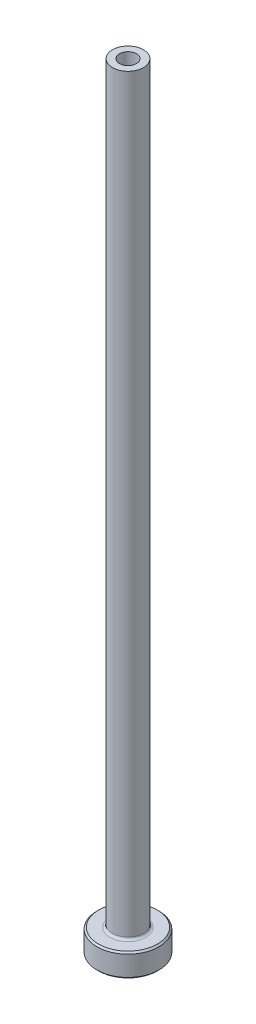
from build123d import *

# Parameters (mm, degrees)
FILLET1_R     = 0.3
CHAMFER1_SIZE = 0.2
CHAMFER3_SIZE = 0.5


with BuildPart() as part:
    # Sketch1 → Revolve1 (revolve)
    with BuildSketch(Plane.XY, mode=Mode.PRIVATE) as revolve1_sk:
        Polygon((-1.1, 100), (-2, 100), (-2, 3), (-4, 3), (-4, 0), (-1.35, 0), (-1.35, 53), (-1.1, 65), align=None)
    revolve(revolve1_sk.sketch.rotate(Axis((0, 92.187680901, 0), (0, -1, 0)), 270), axis=Axis((0, 92.187680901, 0), (0, -1, 0)))

    # Fillet1
    fillet1_edges = [part.edges().sort_by_distance(p)[0] for p in [
        (0, 3, -2),
    ]]
    fillet(fillet1_edges, radius=FILLET1_R)

    # Chamfer1
    chamfer1_edges = [part.edges().sort_by_distance(p)[0] for p in [
        (0, 0, -4),
        (0, 3, -4),
    ]]
    chamfer(chamfer1_edges, length=CHAMFER1_SIZE)

    # Chamfer3
    chamfer3_edges = [part.edges().sort_by_distance(p)[0] for p in [
        (0, 0, -1.35),
    ]]
    chamfer(chamfer3_edges, length=CHAMFER3_SIZE)


solid = part.part
